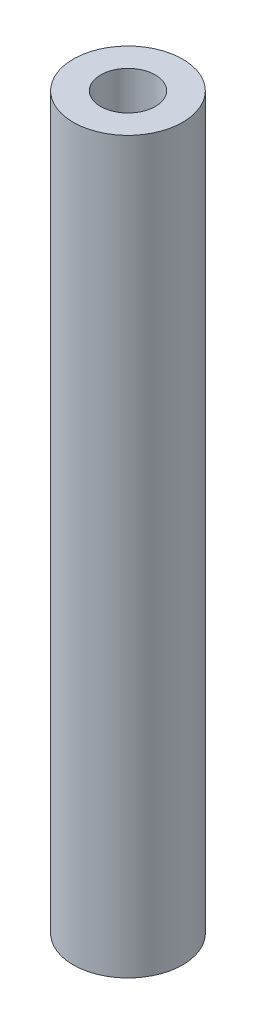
from build123d import *

# Parameters (mm, degrees)
SKETCH1_R      = 3
EXTRUDE1_DEPTH = 40
SKETCH2_R      = 1.5
EXTRUDE2_DEPTH = 3.5
EXTRUDE3_START = -4.5
SKETCH3_R      = 1.5
EXTRUDE3_DEPTH = 4.5


with BuildPart() as part:
    # Sketch1 → Extrude1 (new body)
    with BuildSketch(Plane(origin=(0, 0, 0), x_dir=(1, 0, 0), z_dir=(0, 1, 0))):
        with Locations(Location((0, 0, 0), (0, 0, 270))):
            Circle(SKETCH1_R)
    extrude(amount=EXTRUDE1_DEPTH)

    # Sketch2 → Extrude2 (cut)
    with BuildSketch(Plane(origin=(0, 40, 0), x_dir=(1, 0, 0), z_dir=(0, 1, 0))):
        with Locations(Location((0, 0, 0), (0, 0, 270))):
            Circle(SKETCH2_R)
    extrude(amount=-EXTRUDE2_DEPTH, mode=Mode.SUBTRACT)

    # Sketch3 → Extrude3 (cut)
    with BuildSketch(Plane.XZ.offset(EXTRUDE3_START)):
        with Locations(Location((0, 0, 0), (0, 0, 90))):
            Circle(SKETCH3_R)
    extrude(amount=EXTRUDE3_DEPTH, mode=Mode.SUBTRACT)


solid = part.part
